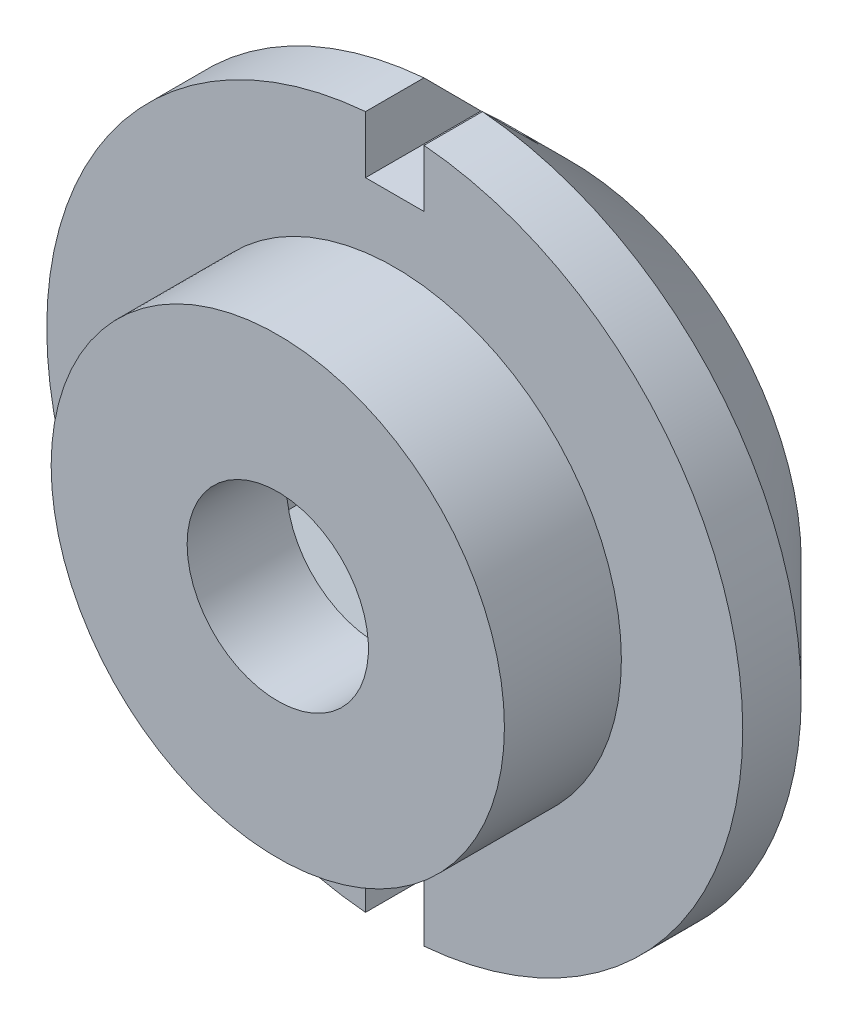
from build123d import *

# Parameters (mm, degrees)
CROQUIS1_R              = 5.95
SALIENTE_EXTRUIR1_DEPTH = 1.5
CROQUIS2_R              = 3.875
SALIENTE_EXTRUIR2_DEPTH = 2
CHAFL_N1_SIZE           = 2
CORTAR_EXTRUIR1_DEPTH   = 3.3
CROQUIS4_R              = 1.55
CORTAR_EXTRUIR2_DEPTH   = 10.038528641
CROQUIS5_W              = 1
CROQUIS5_H              = 2
CORTAR_EXTRUIR3_DEPTH   = 10.788002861


with BuildPart() as part:
    # Croquis1 → Saliente-Extruir1 (new, symmetric)
    with BuildSketch(Plane.XY):
        Circle(CROQUIS1_R)
    extrude(amount=SALIENTE_EXTRUIR1_DEPTH, both=True)

    # Croquis2 → Saliente-Extruir2 (add)
    with BuildSketch(Plane.XY.offset(1.5)):
        Circle(CROQUIS2_R)
    extrude(amount=SALIENTE_EXTRUIR2_DEPTH)

    # Chafl_n1
    chafl_n1_edges = [part.edges().sort_by_distance(p)[0] for p in [
        (-5.95, 0, -1.5),
    ]]
    chamfer(chafl_n1_edges, length=CHAFL_N1_SIZE)

    # Croquis3 → Cortar-Extruir1 (cut)
    with BuildSketch(Plane(origin=(0, 0, -1.5), x_dir=(-1, 0, 0), z_dir=(0, 0, -1))):
        Polygon((0, 3.25), (-2.814582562, 1.625), (-2.814582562, -1.625), (0, -3.25), (2.814582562, -1.625), (2.814582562, 1.625), align=None)
    extrude(amount=-CORTAR_EXTRUIR1_DEPTH, mode=Mode.SUBTRACT)

    # Croquis4 → Cortar-Extruir2 (cut, through all)
    with BuildSketch(Plane(origin=(0, 0, 1.8), x_dir=(-1, 0, 0), z_dir=(0, 0, -1))):
        Circle(CROQUIS4_R)
    extrude(amount=-CORTAR_EXTRUIR2_DEPTH, mode=Mode.SUBTRACT)

    # Croquis5 → Cortar-Extruir3 (cut, through all)
    with BuildSketch(Plane(origin=(0, 0, -1.5), x_dir=(-1, 0, 0), z_dir=(0, 0, -1))):
        with Locations((0, -5.95)):
            Rectangle(CROQUIS5_W, CROQUIS5_H)
        with Locations((0, 5.95)):
            Rectangle(CROQUIS5_W, CROQUIS5_H)
    extrude(amount=-CORTAR_EXTRUIR3_DEPTH, mode=Mode.SUBTRACT)


solid = part.part
